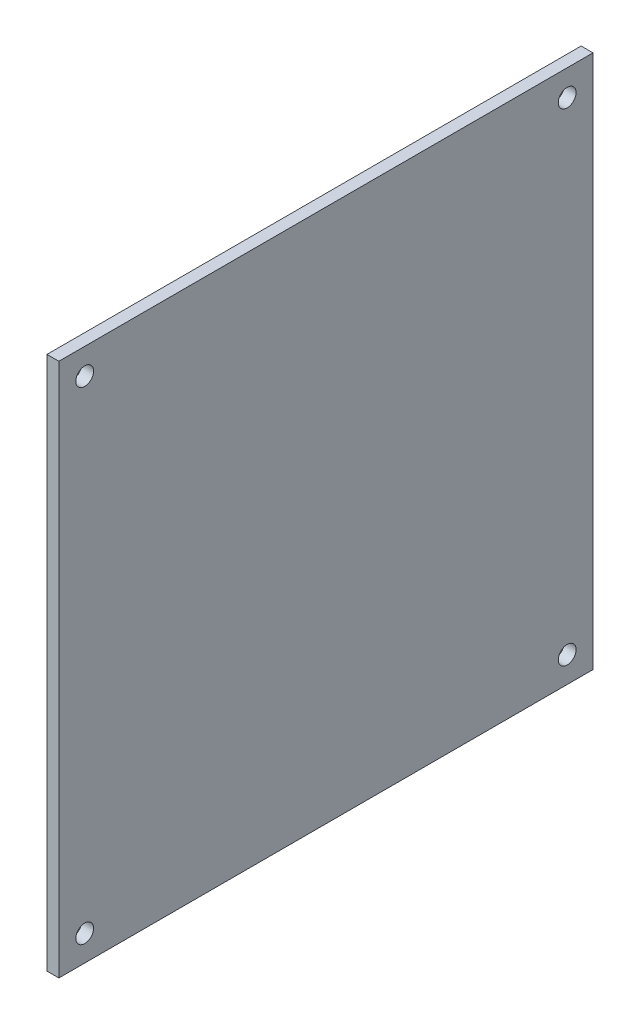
ISO-10303-21;
HEADER;
FILE_DESCRIPTION(('STEP AP214'),'2;1');
FILE_NAME('part.step','',(''),(''),'','','');
FILE_SCHEMA(('AUTOMOTIVE_DESIGN { 1 0 10303 214 1 1 1 1 }'));
ENDSEC;
DATA;
#1=APPLICATION_CONTEXT('core data for automotive mechanical design processes');
#2=APPLICATION_PROTOCOL_DEFINITION('international standard','automotive_design',2000,#1);
#3=PRODUCT_CONTEXT('',#1,'mechanical');
#4=PRODUCT('Part','Part','',(#3));
#5=PRODUCT_RELATED_PRODUCT_CATEGORY('part','',(#4));
#6=PRODUCT_DEFINITION_FORMATION('','',#4);
#7=PRODUCT_DEFINITION_CONTEXT('part definition',#1,'design');
#8=PRODUCT_DEFINITION('design','',#6,#7);
#9=PRODUCT_DEFINITION_SHAPE('','',#8);
#10=(LENGTH_UNIT() NAMED_UNIT(*) SI_UNIT(.MILLI.,.METRE.));
#11=(NAMED_UNIT(*) PLANE_ANGLE_UNIT() SI_UNIT($,.RADIAN.));
#12=(NAMED_UNIT(*) SI_UNIT($,.STERADIAN.) SOLID_ANGLE_UNIT());
#13=UNCERTAINTY_MEASURE_WITH_UNIT(LENGTH_MEASURE(1.E-05),#10,'distance_accuracy_value','');
#14=(GEOMETRIC_REPRESENTATION_CONTEXT(3) GLOBAL_UNCERTAINTY_ASSIGNED_CONTEXT((#13)) GLOBAL_UNIT_ASSIGNED_CONTEXT((#10,
#11,#12)) REPRESENTATION_CONTEXT('',''));
#15=CARTESIAN_POINT('',(0.,0.,0.));
#16=DIRECTION('',(0.,0.,1.));
#17=DIRECTION('',(1.,0.,0.));
#18=AXIS2_PLACEMENT_3D('',#15,#16,#17);
#19=CARTESIAN_POINT('',(2.,0.,0.));
#20=DIRECTION('',(1.,0.,0.));
#21=DIRECTION('',(0.,0.,-1.));
#22=AXIS2_PLACEMENT_3D('',#19,#20,#21);
#23=PLANE('',#22);
#24=CARTESIAN_POINT('',(2.,-41.2776447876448,-40.3989420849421));
#25=DIRECTION('',(1.,0.,0.));
#26=DIRECTION('',(0.,0.,-1.));
#27=AXIS2_PLACEMENT_3D('',#24,#25,#26);
#28=CIRCLE('',#27,1.5);
#29=CARTESIAN_POINT('',(2.,-41.2776447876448,-41.8989420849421));
#30=VERTEX_POINT('',#29);
#31=EDGE_CURVE('E144',#30,#30,#28,.T.);
#32=ORIENTED_EDGE('',*,*,#31,.F.);
#33=EDGE_LOOP('',(#32));
#34=FACE_BOUND('',#33,.T.);
#35=CARTESIAN_POINT('',(2.,40.0200994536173,40.9010579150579));
#36=DIRECTION('',(1.,0.,0.));
#37=DIRECTION('',(0.,0.,-1.));
#38=AXIS2_PLACEMENT_3D('',#35,#36,#37);
#39=CIRCLE('',#38,1.5);
#40=CARTESIAN_POINT('',(2.,40.0200994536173,39.4010579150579));
#41=VERTEX_POINT('',#40);
#42=EDGE_CURVE('E112',#41,#41,#39,.T.);
#43=ORIENTED_EDGE('',*,*,#42,.F.);
#44=EDGE_LOOP('',(#43));
#45=FACE_BOUND('',#44,.T.);
#46=DIRECTION('',(0.,0.,-1.));
#47=VECTOR('',#46,1.);
#48=CARTESIAN_POINT('',(2.,-45.6276447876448,45.2510579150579));
#49=LINE('',#48,#47);
#50=CARTESIAN_POINT('',(2.,-45.6276447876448,45.2510579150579));
#51=VERTEX_POINT('',#50);
#52=CARTESIAN_POINT('',(2.,-45.6276447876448,-44.7489420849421));
#53=VERTEX_POINT('',#52);
#54=EDGE_CURVE('E90',#51,#53,#49,.T.);
#55=ORIENTED_EDGE('',*,*,#54,.T.);
#56=DIRECTION('',(0.,1.,0.));
#57=VECTOR('',#56,1.);
#58=CARTESIAN_POINT('',(2.,-45.6276447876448,-44.7489420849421));
#59=LINE('',#58,#57);
#60=CARTESIAN_POINT('',(2.,44.3723552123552,-44.7489420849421));
#61=VERTEX_POINT('',#60);
#62=EDGE_CURVE('E85',#53,#61,#59,.T.);
#63=ORIENTED_EDGE('',*,*,#62,.T.);
#64=DIRECTION('',(0.,0.,1.));
#65=VECTOR('',#64,1.);
#66=CARTESIAN_POINT('',(2.,44.3723552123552,-44.7489420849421));
#67=LINE('',#66,#65);
#68=CARTESIAN_POINT('',(2.,44.3723552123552,45.2510579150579));
#69=VERTEX_POINT('',#68);
#70=EDGE_CURVE('E88',#61,#69,#67,.T.);
#71=ORIENTED_EDGE('',*,*,#70,.T.);
#72=DIRECTION('',(0.,-1.,0.));
#73=VECTOR('',#72,1.);
#74=CARTESIAN_POINT('',(2.,44.3723552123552,45.2510579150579));
#75=LINE('',#74,#73);
#76=EDGE_CURVE('E55',#69,#51,#75,.T.);
#77=ORIENTED_EDGE('',*,*,#76,.T.);
#78=EDGE_LOOP('',(#55,#63,#71,#77));
#79=FACE_BOUND('',#78,.T.);
#80=CARTESIAN_POINT('',(2.,40.0223552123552,-40.3989420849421));
#81=DIRECTION('',(1.,0.,0.));
#82=DIRECTION('',(0.,0.,-1.));
#83=AXIS2_PLACEMENT_3D('',#80,#81,#82);
#84=CIRCLE('',#83,1.5);
#85=CARTESIAN_POINT('',(2.,40.0223552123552,-41.8989420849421));
#86=VERTEX_POINT('',#85);
#87=EDGE_CURVE('E136',#86,#86,#84,.T.);
#88=ORIENTED_EDGE('',*,*,#87,.F.);
#89=EDGE_LOOP('',(#88));
#90=FACE_BOUND('',#89,.T.);
#91=CARTESIAN_POINT('',(2.,-41.2776447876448,40.9010579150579));
#92=DIRECTION('',(1.,0.,0.));
#93=DIRECTION('',(0.,0.,-1.));
#94=AXIS2_PLACEMENT_3D('',#91,#92,#93);
#95=CIRCLE('',#94,1.5);
#96=CARTESIAN_POINT('',(2.,-41.2776447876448,39.4010579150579));
#97=VERTEX_POINT('',#96);
#98=EDGE_CURVE('E150',#97,#97,#95,.T.);
#99=ORIENTED_EDGE('',*,*,#98,.F.);
#100=EDGE_LOOP('',(#99));
#101=FACE_BOUND('',#100,.T.);
#102=ADVANCED_FACE('F37',(#34,#45,#79,#90,#101),#23,.T.);
#103=CARTESIAN_POINT('',(0.,0.,0.));
#104=DIRECTION('',(1.,0.,0.));
#105=DIRECTION('',(0.,0.,-1.));
#106=AXIS2_PLACEMENT_3D('',#103,#104,#105);
#107=PLANE('',#106);
#108=DIRECTION('',(0.,0.,-1.));
#109=VECTOR('',#108,1.);
#110=CARTESIAN_POINT('',(0.,-45.6276447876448,45.2510579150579));
#111=LINE('',#110,#109);
#112=CARTESIAN_POINT('',(0.,-45.6276447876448,45.2510579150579));
#113=VERTEX_POINT('',#112);
#114=CARTESIAN_POINT('',(0.,-45.6276447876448,-44.7489420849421));
#115=VERTEX_POINT('',#114);
#116=EDGE_CURVE('E108',#113,#115,#111,.T.);
#117=ORIENTED_EDGE('',*,*,#116,.F.);
#118=DIRECTION('',(0.,-1.,0.));
#119=VECTOR('',#118,1.);
#120=CARTESIAN_POINT('',(0.,44.3723552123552,45.2510579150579));
#121=LINE('',#120,#119);
#122=CARTESIAN_POINT('',(0.,44.3723552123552,45.2510579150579));
#123=VERTEX_POINT('',#122);
#124=EDGE_CURVE('E78',#123,#113,#121,.T.);
#125=ORIENTED_EDGE('',*,*,#124,.F.);
#126=DIRECTION('',(0.,0.,1.));
#127=VECTOR('',#126,1.);
#128=CARTESIAN_POINT('',(0.,44.3723552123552,-44.7489420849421));
#129=LINE('',#128,#127);
#130=CARTESIAN_POINT('',(0.,44.3723552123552,-44.7489420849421));
#131=VERTEX_POINT('',#130);
#132=EDGE_CURVE('E72',#131,#123,#129,.T.);
#133=ORIENTED_EDGE('',*,*,#132,.F.);
#134=DIRECTION('',(0.,1.,0.));
#135=VECTOR('',#134,1.);
#136=CARTESIAN_POINT('',(0.,-45.6276447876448,-44.7489420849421));
#137=LINE('',#136,#135);
#138=EDGE_CURVE('E95',#115,#131,#137,.T.);
#139=ORIENTED_EDGE('',*,*,#138,.F.);
#140=EDGE_LOOP('',(#117,#125,#133,#139));
#141=FACE_BOUND('',#140,.T.);
#142=CARTESIAN_POINT('',(0.,40.0200994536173,40.9010579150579));
#143=DIRECTION('',(1.,0.,0.));
#144=DIRECTION('',(0.,0.,-1.));
#145=AXIS2_PLACEMENT_3D('',#142,#143,#144);
#146=CIRCLE('',#145,1.5);
#147=CARTESIAN_POINT('',(0.,40.0200994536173,39.4010579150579));
#148=VERTEX_POINT('',#147);
#149=EDGE_CURVE('E132',#148,#148,#146,.T.);
#150=ORIENTED_EDGE('',*,*,#149,.T.);
#151=EDGE_LOOP('',(#150));
#152=FACE_BOUND('',#151,.T.);
#153=CARTESIAN_POINT('',(0.,40.0223552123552,-40.3989420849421));
#154=DIRECTION('',(1.,0.,0.));
#155=DIRECTION('',(0.,0.,-1.));
#156=AXIS2_PLACEMENT_3D('',#153,#154,#155);
#157=CIRCLE('',#156,1.5);
#158=CARTESIAN_POINT('',(0.,40.0223552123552,-41.8989420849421));
#159=VERTEX_POINT('',#158);
#160=EDGE_CURVE('E140',#159,#159,#157,.T.);
#161=ORIENTED_EDGE('',*,*,#160,.T.);
#162=EDGE_LOOP('',(#161));
#163=FACE_BOUND('',#162,.T.);
#164=CARTESIAN_POINT('',(0.,-41.2776447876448,-40.3989420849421));
#165=DIRECTION('',(1.,0.,0.));
#166=DIRECTION('',(0.,0.,-1.));
#167=AXIS2_PLACEMENT_3D('',#164,#165,#166);
#168=CIRCLE('',#167,1.5);
#169=CARTESIAN_POINT('',(0.,-41.2776447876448,-41.8989420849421));
#170=VERTEX_POINT('',#169);
#171=EDGE_CURVE('E147',#170,#170,#168,.T.);
#172=ORIENTED_EDGE('',*,*,#171,.T.);
#173=EDGE_LOOP('',(#172));
#174=FACE_BOUND('',#173,.T.);
#175=CARTESIAN_POINT('',(0.,-41.2776447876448,40.9010579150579));
#176=DIRECTION('',(1.,0.,0.));
#177=DIRECTION('',(0.,0.,-1.));
#178=AXIS2_PLACEMENT_3D('',#175,#176,#177);
#179=CIRCLE('',#178,1.5);
#180=CARTESIAN_POINT('',(0.,-41.2776447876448,39.4010579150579));
#181=VERTEX_POINT('',#180);
#182=EDGE_CURVE('E153',#181,#181,#179,.T.);
#183=ORIENTED_EDGE('',*,*,#182,.T.);
#184=EDGE_LOOP('',(#183));
#185=FACE_BOUND('',#184,.T.);
#186=ADVANCED_FACE('F126',(#141,#152,#163,#174,#185),#107,.F.);
#187=CARTESIAN_POINT('',(2.,-45.6276447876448,45.2510579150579));
#188=DIRECTION('',(0.,1.,0.));
#189=DIRECTION('',(0.,0.,1.));
#190=AXIS2_PLACEMENT_3D('',#187,#188,#189);
#191=PLANE('',#190);
#192=ORIENTED_EDGE('',*,*,#116,.T.);
#193=DIRECTION('',(-1.,0.,0.));
#194=VECTOR('',#193,1.);
#195=CARTESIAN_POINT('',(2.,-45.6276447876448,-44.7489420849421));
#196=LINE('',#195,#194);
#197=EDGE_CURVE('E11',#53,#115,#196,.T.);
#198=ORIENTED_EDGE('',*,*,#197,.F.);
#199=ORIENTED_EDGE('',*,*,#54,.F.);
#200=DIRECTION('',(-1.,0.,0.));
#201=VECTOR('',#200,1.);
#202=CARTESIAN_POINT('',(2.,-45.6276447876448,45.2510579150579));
#203=LINE('',#202,#201);
#204=EDGE_CURVE('E104',#51,#113,#203,.T.);
#205=ORIENTED_EDGE('',*,*,#204,.T.);
#206=EDGE_LOOP('',(#192,#198,#199,#205));
#207=FACE_BOUND('',#206,.T.);
#208=ADVANCED_FACE('F39',(#207),#191,.F.);
#209=CARTESIAN_POINT('',(2.,-45.6276447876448,-44.7489420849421));
#210=DIRECTION('',(0.,0.,1.));
#211=DIRECTION('',(1.,0.,0.));
#212=AXIS2_PLACEMENT_3D('',#209,#210,#211);
#213=PLANE('',#212);
#214=ORIENTED_EDGE('',*,*,#138,.T.);
#215=DIRECTION('',(-1.,0.,0.));
#216=VECTOR('',#215,1.);
#217=CARTESIAN_POINT('',(2.,44.3723552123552,-44.7489420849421));
#218=LINE('',#217,#216);
#219=EDGE_CURVE('E47',#61,#131,#218,.T.);
#220=ORIENTED_EDGE('',*,*,#219,.F.);
#221=ORIENTED_EDGE('',*,*,#62,.F.);
#222=ORIENTED_EDGE('',*,*,#197,.T.);
#223=EDGE_LOOP('',(#214,#220,#221,#222));
#224=FACE_BOUND('',#223,.T.);
#225=ADVANCED_FACE('F94',(#224),#213,.F.);
#226=CARTESIAN_POINT('',(2.,44.3723552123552,-44.7489420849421));
#227=DIRECTION('',(0.,-1.,0.));
#228=DIRECTION('',(0.,0.,-1.));
#229=AXIS2_PLACEMENT_3D('',#226,#227,#228);
#230=PLANE('',#229);
#231=ORIENTED_EDGE('',*,*,#132,.T.);
#232=DIRECTION('',(-1.,0.,0.));
#233=VECTOR('',#232,1.);
#234=CARTESIAN_POINT('',(2.,44.3723552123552,45.2510579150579));
#235=LINE('',#234,#233);
#236=EDGE_CURVE('E97',#69,#123,#235,.T.);
#237=ORIENTED_EDGE('',*,*,#236,.F.);
#238=ORIENTED_EDGE('',*,*,#70,.F.);
#239=ORIENTED_EDGE('',*,*,#219,.T.);
#240=EDGE_LOOP('',(#231,#237,#238,#239));
#241=FACE_BOUND('',#240,.T.);
#242=ADVANCED_FACE('F98',(#241),#230,.F.);
#243=CARTESIAN_POINT('',(2.,44.3723552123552,45.2510579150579));
#244=DIRECTION('',(0.,0.,-1.));
#245=DIRECTION('',(-1.,0.,0.));
#246=AXIS2_PLACEMENT_3D('',#243,#244,#245);
#247=PLANE('',#246);
#248=ORIENTED_EDGE('',*,*,#124,.T.);
#249=ORIENTED_EDGE('',*,*,#204,.F.);
#250=ORIENTED_EDGE('',*,*,#76,.F.);
#251=ORIENTED_EDGE('',*,*,#236,.T.);
#252=EDGE_LOOP('',(#248,#249,#250,#251));
#253=FACE_BOUND('',#252,.T.);
#254=ADVANCED_FACE('F123',(#253),#247,.F.);
#255=CARTESIAN_POINT('',(2.,40.0200994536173,40.9010579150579));
#256=DIRECTION('',(-1.,0.,0.));
#257=DIRECTION('',(0.,0.,1.));
#258=AXIS2_PLACEMENT_3D('',#255,#256,#257);
#259=CYLINDRICAL_SURFACE('',#258,1.5);
#260=ORIENTED_EDGE('',*,*,#42,.T.);
#261=EDGE_LOOP('',(#260));
#262=FACE_BOUND('',#261,.T.);
#263=ORIENTED_EDGE('',*,*,#149,.F.);
#264=EDGE_LOOP('',(#263));
#265=FACE_BOUND('',#264,.T.);
#266=ADVANCED_FACE('F173',(#262,#265),#259,.F.);
#267=CARTESIAN_POINT('',(2.,40.0223552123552,-40.3989420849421));
#268=DIRECTION('',(-1.,0.,0.));
#269=DIRECTION('',(0.,0.,1.));
#270=AXIS2_PLACEMENT_3D('',#267,#268,#269);
#271=CYLINDRICAL_SURFACE('',#270,1.5);
#272=ORIENTED_EDGE('',*,*,#87,.T.);
#273=EDGE_LOOP('',(#272));
#274=FACE_BOUND('',#273,.T.);
#275=ORIENTED_EDGE('',*,*,#160,.F.);
#276=EDGE_LOOP('',(#275));
#277=FACE_BOUND('',#276,.T.);
#278=ADVANCED_FACE('F225',(#274,#277),#271,.F.);
#279=CARTESIAN_POINT('',(2.,-41.2776447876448,-40.3989420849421));
#280=DIRECTION('',(-1.,0.,0.));
#281=DIRECTION('',(0.,0.,1.));
#282=AXIS2_PLACEMENT_3D('',#279,#280,#281);
#283=CYLINDRICAL_SURFACE('',#282,1.5);
#284=ORIENTED_EDGE('',*,*,#31,.T.);
#285=EDGE_LOOP('',(#284));
#286=FACE_BOUND('',#285,.T.);
#287=ORIENTED_EDGE('',*,*,#171,.F.);
#288=EDGE_LOOP('',(#287));
#289=FACE_BOUND('',#288,.T.);
#290=ADVANCED_FACE('F234',(#286,#289),#283,.F.);
#291=CARTESIAN_POINT('',(2.,-41.2776447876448,40.9010579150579));
#292=DIRECTION('',(-1.,0.,0.));
#293=DIRECTION('',(0.,0.,1.));
#294=AXIS2_PLACEMENT_3D('',#291,#292,#293);
#295=CYLINDRICAL_SURFACE('',#294,1.5);
#296=ORIENTED_EDGE('',*,*,#98,.T.);
#297=EDGE_LOOP('',(#296));
#298=FACE_BOUND('',#297,.T.);
#299=ORIENTED_EDGE('',*,*,#182,.F.);
#300=EDGE_LOOP('',(#299));
#301=FACE_BOUND('',#300,.T.);
#302=ADVANCED_FACE('F160',(#298,#301),#295,.F.);
#303=CLOSED_SHELL('',(#102,#186,#208,#225,#242,#254,#266,#278,#290,#302));
#304=MANIFOLD_SOLID_BREP('B2',#303);
#305=ADVANCED_BREP_SHAPE_REPRESENTATION('',(#18,#304),#14);
#306=SHAPE_DEFINITION_REPRESENTATION(#9,#305);
ENDSEC;
END-ISO-10303-21;
